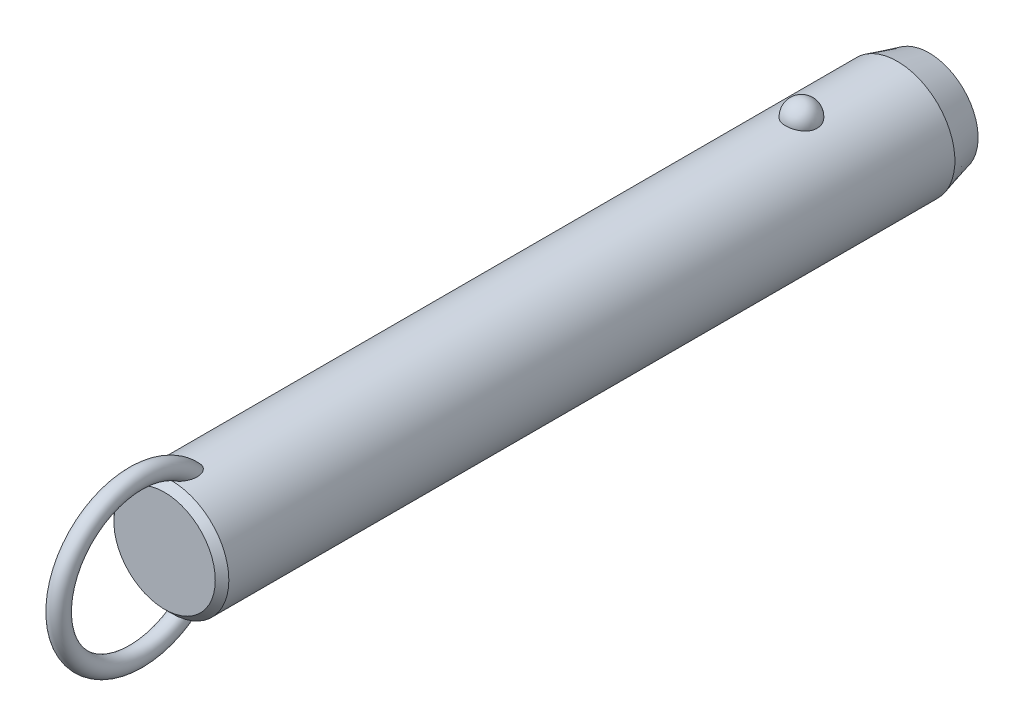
ISO-10303-21;
HEADER;
FILE_DESCRIPTION(('STEP AP214'),'2;1');
FILE_NAME('part.step','',(''),(''),'','','');
FILE_SCHEMA(('AUTOMOTIVE_DESIGN { 1 0 10303 214 1 1 1 1 }'));
ENDSEC;
DATA;
#1=APPLICATION_CONTEXT('core data for automotive mechanical design processes');
#2=APPLICATION_PROTOCOL_DEFINITION('international standard','automotive_design',2000,#1);
#3=PRODUCT_CONTEXT('',#1,'mechanical');
#4=PRODUCT('Part','Part','',(#3));
#5=PRODUCT_RELATED_PRODUCT_CATEGORY('part','',(#4));
#6=PRODUCT_DEFINITION_FORMATION('','',#4);
#7=PRODUCT_DEFINITION_CONTEXT('part definition',#1,'design');
#8=PRODUCT_DEFINITION('design','',#6,#7);
#9=PRODUCT_DEFINITION_SHAPE('','',#8);
#10=(LENGTH_UNIT() NAMED_UNIT(*) SI_UNIT(.MILLI.,.METRE.));
#11=(NAMED_UNIT(*) PLANE_ANGLE_UNIT() SI_UNIT($,.RADIAN.));
#12=(NAMED_UNIT(*) SI_UNIT($,.STERADIAN.) SOLID_ANGLE_UNIT());
#13=UNCERTAINTY_MEASURE_WITH_UNIT(LENGTH_MEASURE(1.E-05),#10,'distance_accuracy_value','');
#14=(GEOMETRIC_REPRESENTATION_CONTEXT(3) GLOBAL_UNCERTAINTY_ASSIGNED_CONTEXT((#13)) GLOBAL_UNIT_ASSIGNED_CONTEXT((#10,
#11,#12)) REPRESENTATION_CONTEXT('',''));
#15=CARTESIAN_POINT('',(0.,0.,0.));
#16=DIRECTION('',(0.,0.,1.));
#17=DIRECTION('',(1.,0.,0.));
#18=AXIS2_PLACEMENT_3D('',#15,#16,#17);
#19=CARTESIAN_POINT('',(0.,0.,124.5));
#20=DIRECTION('',(0.,0.,-1.));
#21=DIRECTION('',(-1.,0.,0.));
#22=AXIS2_PLACEMENT_3D('',#19,#20,#21);
#23=CYLINDRICAL_SURFACE('',#22,12.7);
#24=CARTESIAN_POINT('',(3.46661256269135,12.2177165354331,-3.5));
#25=CARTESIAN_POINT('',(3.4666090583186,12.2177194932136,-3.30432790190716));
#26=CARTESIAN_POINT('',(3.45063567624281,12.2222841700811,-3.10861112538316));
#27=CARTESIAN_POINT('',(3.38712451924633,12.2400345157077,-2.72271899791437));
#28=CARTESIAN_POINT('',(3.33957415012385,12.2532236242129,-2.53254588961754));
#29=CARTESIAN_POINT('',(3.2141234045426,12.286724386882,-2.16324948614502));
#30=CARTESIAN_POINT('',(3.13623639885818,12.3070329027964,-1.98412136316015));
#31=CARTESIAN_POINT('',(2.95205930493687,12.3525018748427,-1.64180592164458));
#32=CARTESIAN_POINT('',(2.84577003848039,12.3776621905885,-1.47861814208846));
#33=CARTESIAN_POINT('',(2.60688050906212,12.4301712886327,-1.17190583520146));
#34=CARTESIAN_POINT('',(2.47415697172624,12.4575299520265,-1.02847897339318));
#35=CARTESIAN_POINT('',(2.18615174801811,12.5112810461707,-0.766177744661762));
#36=CARTESIAN_POINT('',(2.03087002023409,12.5376734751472,-0.64730342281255));
#37=CARTESIAN_POINT('',(1.70237334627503,12.5864761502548,-0.437732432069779));
#38=CARTESIAN_POINT('',(1.52920948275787,12.6088972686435,-0.346958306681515));
#39=CARTESIAN_POINT('',(1.16944170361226,12.6473352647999,-0.195750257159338));
#40=CARTESIAN_POINT('',(0.982839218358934,12.663352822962,-0.135313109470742));
#41=CARTESIAN_POINT('',(0.604961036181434,12.6869706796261,-0.0473241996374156));
#42=CARTESIAN_POINT('',(0.41382314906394,12.6947125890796,-0.0192185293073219));
#43=CARTESIAN_POINT('',(0.0293827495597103,12.7014203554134,0.0051725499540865));
#44=CARTESIAN_POINT('',(-0.163919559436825,12.7003870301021,0.00146092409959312));
#45=CARTESIAN_POINT('',(-0.544374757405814,12.689735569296,-0.0373939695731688));
#46=CARTESIAN_POINT('',(-0.731575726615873,12.6802364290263,-0.0721015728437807));
#47=CARTESIAN_POINT('',(-1.09733277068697,12.6538333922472,-0.171364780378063));
#48=CARTESIAN_POINT('',(-1.27588869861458,12.6369293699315,-0.235920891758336));
#49=CARTESIAN_POINT('',(-1.6204698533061,12.5973946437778,-0.393548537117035));
#50=CARTESIAN_POINT('',(-1.78641865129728,12.5747321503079,-0.486778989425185));
#51=CARTESIAN_POINT('',(-2.10030671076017,12.5261316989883,-0.699110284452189));
#52=CARTESIAN_POINT('',(-2.24824419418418,12.5001934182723,-0.818213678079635));
#53=CARTESIAN_POINT('',(-2.52491489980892,12.4472906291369,-1.08157124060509));
#54=CARTESIAN_POINT('',(-2.65324222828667,12.4203160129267,-1.22624992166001));
#55=CARTESIAN_POINT('',(-2.88410007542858,12.3687509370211,-1.53528325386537));
#56=CARTESIAN_POINT('',(-2.98662883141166,12.3441606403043,-1.69963924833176));
#57=CARTESIAN_POINT('',(-3.16432417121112,12.2998199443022,-2.04548497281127));
#58=CARTESIAN_POINT('',(-3.23917525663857,12.2801261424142,-2.22714424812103));
#59=CARTESIAN_POINT('',(-3.35800573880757,12.248167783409,-2.6009138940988));
#60=CARTESIAN_POINT('',(-3.4019860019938,12.2359030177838,-2.79302397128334));
#61=CARTESIAN_POINT('',(-3.45784812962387,12.2202347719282,-3.18140279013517));
#62=CARTESIAN_POINT('',(-3.46986123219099,12.2167950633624,-3.37765118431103));
#63=CARTESIAN_POINT('',(-3.46186273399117,12.2190638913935,-3.76943689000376));
#64=CARTESIAN_POINT('',(-3.44185196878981,12.2247721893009,-3.96497421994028));
#65=CARTESIAN_POINT('',(-3.37048652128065,12.2446381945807,-4.34881728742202));
#66=CARTESIAN_POINT('',(-3.31928253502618,12.2587552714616,-4.53715319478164));
#67=CARTESIAN_POINT('',(-3.18693461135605,12.2938237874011,-4.90231727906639));
#68=CARTESIAN_POINT('',(-3.1057895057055,12.3147754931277,-5.07914500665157));
#69=CARTESIAN_POINT('',(-2.91506431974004,12.3613125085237,-5.41732059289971));
#70=CARTESIAN_POINT('',(-2.80533587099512,12.3869217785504,-5.57858147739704));
#71=CARTESIAN_POINT('',(-2.560414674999,12.4398525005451,-5.88013283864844));
#72=CARTESIAN_POINT('',(-2.42522099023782,12.4671740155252,-6.02042254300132));
#73=CARTESIAN_POINT('',(-2.1323357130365,12.5205965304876,-6.27662798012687));
#74=CARTESIAN_POINT('',(-1.97456596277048,12.5466928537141,-6.3924554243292));
#75=CARTESIAN_POINT('',(-1.64115839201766,12.5946384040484,-6.59583547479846));
#76=CARTESIAN_POINT('',(-1.46552179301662,12.6164879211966,-6.68339001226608));
#77=CARTESIAN_POINT('',(-1.10356050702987,12.6532533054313,-6.82682153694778));
#78=CARTESIAN_POINT('',(-0.9173913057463,12.6682500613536,-6.8830698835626));
#79=CARTESIAN_POINT('',(-0.537836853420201,12.6900288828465,-6.96386887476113));
#80=CARTESIAN_POINT('',(-0.344452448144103,12.6968119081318,-6.9884232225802));
#81=CARTESIAN_POINT('',(0.0402577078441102,12.7013667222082,-7.00496469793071));
#82=CARTESIAN_POINT('',(0.231556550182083,12.6993008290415,-6.99753844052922));
#83=CARTESIAN_POINT('',(0.610105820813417,12.6867505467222,-6.9516636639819));
#84=CARTESIAN_POINT('',(0.797356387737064,12.6762664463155,-6.913216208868));
#85=CARTESIAN_POINT('',(1.16186657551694,12.6480587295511,-6.80658431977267));
#86=CARTESIAN_POINT('',(1.33915951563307,12.6303611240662,-6.73850666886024));
#87=CARTESIAN_POINT('',(1.67968518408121,12.5896027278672,-6.5745087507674));
#88=CARTESIAN_POINT('',(1.84291705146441,12.5665416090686,-6.47858678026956));
#89=CARTESIAN_POINT('',(2.15340192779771,12.5171072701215,-6.25982455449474));
#90=CARTESIAN_POINT('',(2.30037831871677,12.4906895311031,-6.13660186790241));
#91=CARTESIAN_POINT('',(2.5717412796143,12.4376567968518,-5.86739587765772));
#92=CARTESIAN_POINT('',(2.69612388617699,12.4110417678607,-5.72140858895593));
#93=CARTESIAN_POINT('',(2.92107785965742,12.360051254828,-5.40794137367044));
#94=CARTESIAN_POINT('',(3.02121329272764,12.3357209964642,-5.24014110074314));
#95=CARTESIAN_POINT('',(3.19236291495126,12.2925446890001,-4.88969865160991));
#96=CARTESIAN_POINT('',(3.26338839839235,12.2736965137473,-4.70706226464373));
#97=CARTESIAN_POINT('',(3.36788038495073,12.245404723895,-4.35469510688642));
#98=CARTESIAN_POINT('',(3.40484026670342,12.2351018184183,-4.18605935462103));
#99=CARTESIAN_POINT('',(3.45420764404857,12.2212564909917,-3.84496058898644));
#100=CARTESIAN_POINT('',(3.46661565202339,12.2177139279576,-3.67249765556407));
#101=CARTESIAN_POINT('',(3.46661256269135,12.2177165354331,-3.5));
#102=B_SPLINE_CURVE_WITH_KNOTS('',3,(#24,#25,#26,#27,#28,#29,#30,#31,#32,#33,#34,#35,#36,#37,
#38,#39,#40,#41,#42,#43,#44,#45,#46,#47,#48,#49,#50,#51,#52,#53,#54,#55,#56,#57,#58,#59,#60,#61,
#62,#63,#64,#65,#66,#67,#68,#69,#70,#71,#72,#73,#74,#75,#76,#77,#78,#79,#80,#81,#82,#83,#84,#85,
#86,#87,#88,#89,#90,#91,#92,#93,#94,#95,#96,#97,#98,#99,#100,#101),.UNSPECIFIED.,.T.,.F.,(4,2,2,
2,2,2,2,2,2,2,2,2,2,2,2,2,2,2,2,2,2,2,2,2,2,2,2,2,2,2,2,2,2,2,2,2,2,2,4),(0.,0.586396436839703,
1.17302689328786,1.7593990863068,2.34575431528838,2.93491084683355,3.52406845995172,
4.11158733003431,4.69904375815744,5.2762784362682,5.85345931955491,6.42265312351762,
6.99185659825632,7.56427334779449,8.136746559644,8.71981013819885,9.3029135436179,
9.89247258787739,10.4820150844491,11.0691335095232,11.6562366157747,12.2405256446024,
12.8248374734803,13.412244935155,13.9996740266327,14.5891883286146,15.1786623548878,
15.7609861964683,16.3432419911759,16.9148635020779,17.4864654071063,18.0560241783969,
18.6256177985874,19.2037609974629,19.7820055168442,20.3699810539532,20.957728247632,
21.4746855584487,21.9916320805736),.UNSPECIFIED.);
#103=CARTESIAN_POINT('',(3.46661256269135,12.2177165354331,-3.5));
#104=VERTEX_POINT('',#103);
#105=EDGE_CURVE('E41',#104,#104,#102,.T.);
#106=ORIENTED_EDGE('',*,*,#105,.T.);
#107=EDGE_LOOP('',(#106));
#108=FACE_BOUND('',#107,.T.);
#109=CARTESIAN_POINT('',(0.,0.,135.7));
#110=DIRECTION('',(0.,0.,1.));
#111=DIRECTION('',(1.,0.,0.));
#112=AXIS2_PLACEMENT_3D('',#109,#110,#111);
#113=CIRCLE('',#112,12.7);
#114=CARTESIAN_POINT('',(12.7,0.,135.7));
#115=VERTEX_POINT('',#114);
#116=EDGE_CURVE('E10',#115,#115,#113,.F.);
#117=ORIENTED_EDGE('',*,*,#116,.T.);
#118=EDGE_LOOP('',(#117));
#119=FACE_BOUND('',#118,.T.);
#120=CARTESIAN_POINT('',(-0.548122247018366,-12.6881662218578,129.443218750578));
#121=CARTESIAN_POINT('',(-0.648865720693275,-12.6838128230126,129.477926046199));
#122=CARTESIAN_POINT('',(-0.746398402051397,-12.6783867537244,129.522042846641));
#123=CARTESIAN_POINT('',(-0.932125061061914,-12.666091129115,129.626764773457));
#124=CARTESIAN_POINT('',(-1.02030388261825,-12.6592192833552,129.687396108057));
#125=CARTESIAN_POINT('',(-1.18487740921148,-12.6448747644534,129.821847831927));
#126=CARTESIAN_POINT('',(-1.26134296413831,-12.637406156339,129.895582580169));
#127=CARTESIAN_POINT('',(-1.4023120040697,-12.6225412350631,130.053604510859));
#128=CARTESIAN_POINT('',(-1.466814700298,-12.6151449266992,130.13789238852));
#129=CARTESIAN_POINT('',(-1.60714786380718,-12.5981718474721,130.349657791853));
#130=CARTESIAN_POINT('',(-1.67725126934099,-12.588900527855,130.480962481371));
#131=CARTESIAN_POINT('',(-1.79536591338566,-12.5725964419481,130.753247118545));
#132=CARTESIAN_POINT('',(-1.84333535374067,-12.5655679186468,130.894244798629));
#133=CARTESIAN_POINT('',(-1.93422576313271,-12.5519624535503,131.237645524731));
#134=CARTESIAN_POINT('',(-1.96788773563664,-12.5466298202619,131.442557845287));
#135=CARTESIAN_POINT('',(-1.9941399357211,-12.542463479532,131.751760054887));
#136=CARTESIAN_POINT('',(-1.99883864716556,-12.5417153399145,131.855298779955));
#137=CARTESIAN_POINT('',(-2.00078003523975,-12.5414074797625,132.06245124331));
#138=CARTESIAN_POINT('',(-1.99802449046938,-12.5418474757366,132.166064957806));
#139=CARTESIAN_POINT('',(-1.98336733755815,-12.5441750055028,132.41032076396));
#140=CARTESIAN_POINT('',(-1.96851430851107,-12.5465291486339,132.550780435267));
#141=CARTESIAN_POINT('',(-1.92707089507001,-12.5529612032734,132.829960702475));
#142=CARTESIAN_POINT('',(-1.90047458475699,-12.5570399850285,132.968680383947));
#143=CARTESIAN_POINT('',(-1.8361912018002,-12.5666008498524,133.24341135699));
#144=CARTESIAN_POINT('',(-1.79850828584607,-12.57208240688,133.379423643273));
#145=CARTESIAN_POINT('',(-1.71223796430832,-12.5841228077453,133.647842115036));
#146=CARTESIAN_POINT('',(-1.66365679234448,-12.5906810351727,133.780250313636));
#147=CARTESIAN_POINT('',(-1.5780450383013,-12.6016176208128,133.98548877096));
#148=CARTESIAN_POINT('',(-1.54477252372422,-12.6057501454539,134.059914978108));
#149=CARTESIAN_POINT('',(-1.47424480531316,-12.6141930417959,134.206839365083));
#150=CARTESIAN_POINT('',(-1.436990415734,-12.6185033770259,134.279337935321));
#151=CARTESIAN_POINT('',(-1.35825795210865,-12.6272207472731,134.421892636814));
#152=CARTESIAN_POINT('',(-1.31678520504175,-12.6316276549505,134.491951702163));
#153=CARTESIAN_POINT('',(-1.22917793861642,-12.6404532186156,134.629070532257));
#154=CARTESIAN_POINT('',(-1.18304514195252,-12.6448718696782,134.696131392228));
#155=CARTESIAN_POINT('',(-1.0724641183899,-12.6547893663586,134.843874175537));
#156=CARTESIAN_POINT('',(-1.00642239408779,-12.6602600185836,134.923384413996));
#157=CARTESIAN_POINT('',(-0.864441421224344,-12.6707460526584,135.073169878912));
#158=CARTESIAN_POINT('',(-0.78851691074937,-12.6757620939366,135.143458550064));
#159=CARTESIAN_POINT('',(-0.65221547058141,-12.6833591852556,135.248680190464));
#160=CARTESIAN_POINT('',(-0.59498203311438,-12.6861973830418,135.287624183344));
#161=CARTESIAN_POINT('',(-0.475269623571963,-12.6912445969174,135.356489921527));
#162=CARTESIAN_POINT('',(-0.412800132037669,-12.6934547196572,135.386427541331));
#163=CARTESIAN_POINT('',(-0.295749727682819,-12.6966636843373,135.42975652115));
#164=CARTESIAN_POINT('',(-0.241949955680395,-12.6978134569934,135.445218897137));
#165=CARTESIAN_POINT('',(-0.132508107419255,-12.6994261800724,135.466884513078));
#166=CARTESIAN_POINT('',(-0.0768679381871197,-12.6998898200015,135.473097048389));
#167=CARTESIAN_POINT('',(0.03476966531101,-12.7000752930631,135.475583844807));
#168=CARTESIAN_POINT('',(0.0907676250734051,-12.6997954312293,135.471835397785));
#169=CARTESIAN_POINT('',(0.201283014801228,-12.6985255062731,135.454788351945));
#170=CARTESIAN_POINT('',(0.255799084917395,-12.6975348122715,135.441481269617));
#171=CARTESIAN_POINT('',(0.376042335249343,-12.6946091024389,135.40203792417));
#172=CARTESIAN_POINT('',(0.440950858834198,-12.6924943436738,135.373449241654));
#173=CARTESIAN_POINT('',(0.565350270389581,-12.6875639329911,135.306323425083));
#174=CARTESIAN_POINT('',(0.624828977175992,-12.6847467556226,135.267764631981));
#175=CARTESIAN_POINT('',(0.774116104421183,-12.6767252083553,135.156949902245));
#176=CARTESIAN_POINT('',(0.859449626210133,-12.6711344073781,135.078760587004));
#177=CARTESIAN_POINT('',(1.01789440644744,-12.6593922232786,134.910943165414));
#178=CARTESIAN_POINT('',(1.09096902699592,-12.653239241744,134.821282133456));
#179=CARTESIAN_POINT('',(1.22268793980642,-12.6411674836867,134.640265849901));
#180=CARTESIAN_POINT('',(1.28193986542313,-12.6352572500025,134.549345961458));
#181=CARTESIAN_POINT('',(1.39259777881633,-12.6235401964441,134.362792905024));
#182=CARTESIAN_POINT('',(1.44399707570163,-12.6177334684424,134.267155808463));
#183=CARTESIAN_POINT('',(1.53972870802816,-12.6064093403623,134.072273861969));
#184=CARTESIAN_POINT('',(1.58405262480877,-12.6008922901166,133.973024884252));
#185=CARTESIAN_POINT('',(1.66600705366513,-12.5903187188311,133.771772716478));
#186=CARTESIAN_POINT('',(1.70363651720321,-12.5852622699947,133.669769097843));
#187=CARTESIAN_POINT('',(1.77545379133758,-12.5753406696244,133.454358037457));
#188=CARTESIAN_POINT('',(1.80903453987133,-12.5705328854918,133.340745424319));
#189=CARTESIAN_POINT('',(1.86844163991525,-12.5618400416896,133.111457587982));
#190=CARTESIAN_POINT('',(1.89426665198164,-12.5579551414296,132.995782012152));
#191=CARTESIAN_POINT('',(1.9378546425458,-12.5513030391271,132.763007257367));
#192=CARTESIAN_POINT('',(1.9556264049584,-12.5485346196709,132.645909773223));
#193=CARTESIAN_POINT('',(1.98264463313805,-12.5442934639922,132.410747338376));
#194=CARTESIAN_POINT('',(1.99189298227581,-12.5428204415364,132.29268260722));
#195=CARTESIAN_POINT('',(2.00416068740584,-12.540871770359,131.980622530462));
#196=CARTESIAN_POINT('',(1.99944433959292,-12.541631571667,131.786229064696));
#197=CARTESIAN_POINT('',(1.96113755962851,-12.5476846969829,131.400309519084));
#198=CARTESIAN_POINT('',(1.92758341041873,-12.5529723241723,131.208780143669));
#199=CARTESIAN_POINT('',(1.83934342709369,-12.5661532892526,130.882272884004));
#200=CARTESIAN_POINT('',(1.79215440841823,-12.5730485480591,130.74524997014));
#201=CARTESIAN_POINT('',(1.67676242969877,-12.588958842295,130.480445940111));
#202=CARTESIAN_POINT('',(1.60859050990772,-12.597970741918,130.352651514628));
#203=CARTESIAN_POINT('',(1.46583832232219,-12.6152829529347,130.135800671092));
#204=CARTESIAN_POINT('',(1.39525727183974,-12.6233659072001,130.04410500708));
#205=CARTESIAN_POINT('',(1.23992594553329,-12.6395676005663,129.873485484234));
#206=CARTESIAN_POINT('',(1.15517932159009,-12.6476863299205,129.794558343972));
#207=CARTESIAN_POINT('',(0.971995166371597,-12.6630846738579,129.652643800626));
#208=CARTESIAN_POINT('',(0.873456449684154,-12.6703572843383,129.589784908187));
#209=CARTESIAN_POINT('',(0.665847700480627,-12.6829569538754,129.484487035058));
#210=CARTESIAN_POINT('',(0.556784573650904,-12.688285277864,129.442034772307));
#211=CARTESIAN_POINT('',(0.347338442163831,-12.6956226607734,129.384443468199));
#212=CARTESIAN_POINT('',(0.247759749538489,-12.6979816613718,129.366399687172));
#213=CARTESIAN_POINT('',(0.0470218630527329,-12.7003077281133,129.348600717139));
#214=CARTESIAN_POINT('',(-0.0541350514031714,-12.7002779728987,129.348821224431));
#215=CARTESIAN_POINT('',(-0.221414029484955,-12.6982482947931,129.364363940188));
#216=CARTESIAN_POINT('',(-0.288055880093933,-12.6969033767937,129.374666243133));
#217=CARTESIAN_POINT('',(-0.419599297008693,-12.6932369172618,129.40313489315));
#218=CARTESIAN_POINT('',(-0.484501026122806,-12.6909154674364,129.421300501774));
#219=CARTESIAN_POINT('',(-0.548122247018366,-12.6881662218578,129.443218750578));
#220=B_SPLINE_CURVE_WITH_KNOTS('',3,(#120,#121,#122,#123,#124,#125,#126,#127,#128,#129,#130,
#131,#132,#133,#134,#135,#136,#137,#138,#139,#140,#141,#142,#143,#144,#145,#146,#147,#148,#149,
#150,#151,#152,#153,#154,#155,#156,#157,#158,#159,#160,#161,#162,#163,#164,#165,#166,#167,#168,
#169,#170,#171,#172,#173,#174,#175,#176,#177,#178,#179,#180,#181,#182,#183,#184,#185,#186,#187,
#188,#189,#190,#191,#192,#193,#194,#195,#196,#197,#198,#199,#200,#201,#202,#203,#204,#205,#206,
#207,#208,#209,#210,#211,#212,#213,#214,#215,#216,#217,#218,#219),.UNSPECIFIED.,.T.,.F.,(4,2,2,
2,2,2,2,2,2,2,2,2,2,2,2,2,2,2,2,2,2,2,2,2,2,2,2,2,2,2,2,2,2,2,2,2,2,2,2,2,2,2,2,2,2,2,2,2,2,4),
(0.,0.31964225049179,0.639794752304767,0.957927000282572,1.27608021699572,1.72100165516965,
2.16675988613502,2.78630021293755,3.09705782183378,3.40774128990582,3.83096358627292,
4.25439969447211,4.67767724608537,5.10071330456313,5.34550297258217,5.59024267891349,
5.83467707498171,6.07902143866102,6.38891080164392,6.69834321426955,6.9056091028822,
7.11250749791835,7.27977315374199,7.44687060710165,7.61434932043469,7.78197685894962,
7.99365544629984,8.20579780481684,8.55147335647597,8.89816429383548,9.22375138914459,
9.54961437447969,9.8758622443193,10.202161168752,10.557587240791,10.9130746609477,
11.2681734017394,11.6231936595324,12.2046601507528,12.7853961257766,13.219164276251,
13.6522938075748,13.9989174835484,14.3454519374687,14.6946768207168,15.0436740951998,
15.3457513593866,15.6474266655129,15.8493051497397,16.0511646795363),.UNSPECIFIED.);
#221=CARTESIAN_POINT('',(-0.548122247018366,-12.6881662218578,129.443218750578));
#222=VERTEX_POINT('',#221);
#223=EDGE_CURVE('E59',#222,#222,#220,.T.);
#224=ORIENTED_EDGE('',*,*,#223,.T.);
#225=EDGE_LOOP('',(#224));
#226=FACE_BOUND('',#225,.T.);
#227=CARTESIAN_POINT('',(-0.548122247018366,12.6881662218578,129.443218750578));
#228=CARTESIAN_POINT('',(-0.459436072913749,12.6919968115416,129.412673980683));
#229=CARTESIAN_POINT('',(-0.368189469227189,12.6949996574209,129.389391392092));
#230=CARTESIAN_POINT('',(-0.18302400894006,12.6990186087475,129.358406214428));
#231=CARTESIAN_POINT('',(-0.0891049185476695,12.7000345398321,129.350704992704));
#232=CARTESIAN_POINT('',(0.0987147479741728,12.6999636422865,129.351245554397));
#233=CARTESIAN_POINT('',(0.192615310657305,12.6988761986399,129.359492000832));
#234=CARTESIAN_POINT('',(0.377658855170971,12.6947211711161,129.391551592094));
#235=CARTESIAN_POINT('',(0.468801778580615,12.6916535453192,129.415365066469));
#236=CARTESIAN_POINT('',(0.645809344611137,12.6838788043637,129.47745651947));
#237=CARTESIAN_POINT('',(0.731679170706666,12.6791733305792,129.515720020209));
#238=CARTESIAN_POINT('',(0.896315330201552,12.6686004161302,129.605120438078));
#239=CARTESIAN_POINT('',(0.975080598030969,12.6627328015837,129.656259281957));
#240=CARTESIAN_POINT('',(1.12963655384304,12.6499161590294,129.77367820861));
#241=CARTESIAN_POINT('',(1.20478673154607,12.6429194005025,129.840792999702));
#242=CARTESIAN_POINT('',(1.34448241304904,12.6288282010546,129.98522507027));
#243=CARTESIAN_POINT('',(1.40902173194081,12.621733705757,130.062548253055));
#244=CARTESIAN_POINT('',(1.55208211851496,12.6050877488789,130.259247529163));
#245=CARTESIAN_POINT('',(1.62510490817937,12.5957546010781,130.382654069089));
#246=CARTESIAN_POINT('',(1.7501904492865,12.5789823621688,130.639769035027));
#247=CARTESIAN_POINT('',(1.80221377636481,12.5715468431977,130.773496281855));
#248=CARTESIAN_POINT('',(1.90309965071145,12.5567434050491,131.098351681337));
#249=CARTESIAN_POINT('',(1.94342317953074,12.5504515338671,131.292161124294));
#250=CARTESIAN_POINT('',(1.99332997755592,12.5426147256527,131.68378810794));
#251=CARTESIAN_POINT('',(2.00285305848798,12.5410790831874,131.881612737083));
#252=CARTESIAN_POINT('',(1.99678999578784,12.5420407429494,132.216642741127));
#253=CARTESIAN_POINT('',(1.98794117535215,12.5434564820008,132.354042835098));
#254=CARTESIAN_POINT('',(1.95865119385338,12.5480641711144,132.627639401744));
#255=CARTESIAN_POINT('',(1.93820436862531,12.5512569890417,132.763835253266));
#256=CARTESIAN_POINT('',(1.88647896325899,12.5591352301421,133.034249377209));
#257=CARTESIAN_POINT('',(1.85518800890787,12.5638223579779,133.168465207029));
#258=CARTESIAN_POINT('',(1.78217886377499,12.5743868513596,133.433936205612));
#259=CARTESIAN_POINT('',(1.74046509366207,12.5802637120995,133.565192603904));
#260=CARTESIAN_POINT('',(1.66024095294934,12.5910571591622,133.786085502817));
#261=CARTESIAN_POINT('',(1.62434772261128,12.5957535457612,133.876690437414));
#262=CARTESIAN_POINT('',(1.54709009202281,12.6054762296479,134.055512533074));
#263=CARTESIAN_POINT('',(1.50572681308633,12.6105024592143,134.143730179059));
#264=CARTESIAN_POINT('',(1.41728020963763,12.620748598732,134.316932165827));
#265=CARTESIAN_POINT('',(1.37021377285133,12.625967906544,134.401925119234));
#266=CARTESIAN_POINT('',(1.26969620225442,12.6364721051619,134.568007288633));
#267=CARTESIAN_POINT('',(1.21624929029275,12.6417569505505,134.649099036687));
#268=CARTESIAN_POINT('',(1.10304413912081,12.6521331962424,134.804702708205));
#269=CARTESIAN_POINT('',(1.04340936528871,12.657226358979,134.879303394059));
#270=CARTESIAN_POINT('',(0.915919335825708,12.667090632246,135.021324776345));
#271=CARTESIAN_POINT('',(0.84806456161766,12.6718617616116,135.08874589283));
#272=CARTESIAN_POINT('',(0.717035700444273,12.67987711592,135.200624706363));
#273=CARTESIAN_POINT('',(0.655526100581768,12.6832377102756,135.246997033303));
#274=CARTESIAN_POINT('',(0.525985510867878,12.6892676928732,135.329619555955));
#275=CARTESIAN_POINT('',(0.457969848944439,12.6919386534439,135.365892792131));
#276=CARTESIAN_POINT('',(0.334859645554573,12.695691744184,135.416657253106));
#277=CARTESIAN_POINT('',(0.281116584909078,12.6970073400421,135.434373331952));
#278=CARTESIAN_POINT('',(0.171425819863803,12.6989609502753,135.460642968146));
#279=CARTESIAN_POINT('',(0.115480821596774,12.699599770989,135.469207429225));
#280=CARTESIAN_POINT('',(0.00272618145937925,12.7001251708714,135.476253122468));
#281=CARTESIAN_POINT('',(-0.0540859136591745,12.7000089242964,135.474696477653));
#282=CARTESIAN_POINT('',(-0.166544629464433,12.6990328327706,135.461600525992));
#283=CARTESIAN_POINT('',(-0.222190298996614,12.6981724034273,135.450053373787));
#284=CARTESIAN_POINT('',(-0.342018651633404,12.695562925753,135.414912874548));
#285=CARTESIAN_POINT('',(-0.405606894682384,12.6936676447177,135.38933225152));
#286=CARTESIAN_POINT('',(-0.527815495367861,12.6891754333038,135.328311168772));
#287=CARTESIAN_POINT('',(-0.586425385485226,12.6865770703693,135.292850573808));
#288=CARTESIAN_POINT('',(-0.731842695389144,12.6792129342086,135.191496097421));
#289=CARTESIAN_POINT('',(-0.81470941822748,12.6740767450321,135.1200395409));
#290=CARTESIAN_POINT('',(-0.969101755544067,12.6632083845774,134.96589007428));
#291=CARTESIAN_POINT('',(-1.04059564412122,12.6574746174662,134.883166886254));
#292=CARTESIAN_POINT('',(-1.16981116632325,12.6461638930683,134.715809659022));
#293=CARTESIAN_POINT('',(-1.22811369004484,12.6405994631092,134.631616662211));
#294=CARTESIAN_POINT('',(-1.33743405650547,12.6295007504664,134.458579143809));
#295=CARTESIAN_POINT('',(-1.38844577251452,12.6239664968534,134.369730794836));
#296=CARTESIAN_POINT('',(-1.48400702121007,12.6130898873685,134.188389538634));
#297=CARTESIAN_POINT('',(-1.52854232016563,12.6077479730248,134.095889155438));
#298=CARTESIAN_POINT('',(-1.61150113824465,12.5974127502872,133.908160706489));
#299=CARTESIAN_POINT('',(-1.64992317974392,12.5924195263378,133.812931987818));
#300=CARTESIAN_POINT('',(-1.73468589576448,12.581070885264,133.58289362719));
#301=CARTESIAN_POINT('',(-1.77831261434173,12.5749388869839,133.447066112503));
#302=CARTESIAN_POINT('',(-1.85439734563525,12.5639437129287,133.172212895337));
#303=CARTESIAN_POINT('',(-1.88684994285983,12.5590811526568,133.033185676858));
#304=CARTESIAN_POINT('',(-1.94008483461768,12.550968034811,132.75309235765));
#305=CARTESIAN_POINT('',(-1.96088706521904,12.5477147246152,132.612030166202));
#306=CARTESIAN_POINT('',(-1.99000539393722,12.5431291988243,132.328668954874));
#307=CARTESIAN_POINT('',(-1.99832911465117,12.5417958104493,132.186370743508));
#308=CARTESIAN_POINT('',(-2.00166624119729,12.5412674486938,131.857627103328));
#309=CARTESIAN_POINT('',(-1.99178843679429,12.5428579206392,131.671088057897));
#310=CARTESIAN_POINT('',(-1.94455183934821,12.5502731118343,131.30162404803));
#311=CARTESIAN_POINT('',(-1.90724032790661,12.5560905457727,131.118693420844));
#312=CARTESIAN_POINT('',(-1.81330718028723,12.5699462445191,130.804848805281));
#313=CARTESIAN_POINT('',(-1.76338820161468,12.5771273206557,130.671910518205));
#314=CARTESIAN_POINT('',(-1.64305018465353,12.593414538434,130.415681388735));
#315=CARTESIAN_POINT('',(-1.57265346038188,12.6025185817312,130.292380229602));
#316=CARTESIAN_POINT('',(-1.42634956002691,12.6198178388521,130.083564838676));
#317=CARTESIAN_POINT('',(-1.35423772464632,12.6278405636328,129.995384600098));
#318=CARTESIAN_POINT('',(-1.19645664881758,12.6437632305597,129.832107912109));
#319=CARTESIAN_POINT('',(-1.1108053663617,12.6516633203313,129.756994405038));
#320=CARTESIAN_POINT('',(-0.947219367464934,12.6648319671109,129.637811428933));
#321=CARTESIAN_POINT('',(-0.871624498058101,12.670300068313,129.590541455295));
#322=CARTESIAN_POINT('',(-0.714161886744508,12.6801492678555,129.5077413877));
#323=CARTESIAN_POINT('',(-0.632295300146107,12.684530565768,129.47220913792));
#324=CARTESIAN_POINT('',(-0.548122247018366,12.6881662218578,129.443218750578));
#325=B_SPLINE_CURVE_WITH_KNOTS('',3,(#227,#228,#229,#230,#231,#232,#233,#234,#235,#236,#237,
#238,#239,#240,#241,#242,#243,#244,#245,#246,#247,#248,#249,#250,#251,#252,#253,#254,#255,#256,
#257,#258,#259,#260,#261,#262,#263,#264,#265,#266,#267,#268,#269,#270,#271,#272,#273,#274,#275,
#276,#277,#278,#279,#280,#281,#282,#283,#284,#285,#286,#287,#288,#289,#290,#291,#292,#293,#294,
#295,#296,#297,#298,#299,#300,#301,#302,#303,#304,#305,#306,#307,#308,#309,#310,#311,#312,#313,
#314,#315,#316,#317,#318,#319,#320,#321,#322,#323,#324),.UNSPECIFIED.,.T.,.F.,(4,2,2,2,2,2,2,2,
2,2,2,2,2,2,2,2,2,2,2,2,2,2,2,2,2,2,2,2,2,2,2,2,2,2,2,2,2,2,2,2,2,2,2,2,2,2,2,2,4),(0.,
0.281328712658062,0.562682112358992,0.844117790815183,1.12555942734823,1.40671982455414,
1.68792232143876,1.98972294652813,2.29169886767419,2.72039860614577,3.14989948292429,
3.74084916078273,4.33295293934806,4.74554109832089,5.15833092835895,5.57159335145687,
5.98468079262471,6.27722775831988,6.56971484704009,6.86135609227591,7.15280542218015,
7.43927407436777,7.72572595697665,7.95635862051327,8.18646071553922,8.35559393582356,
8.52452541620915,8.6940894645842,8.86378678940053,9.06834348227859,9.27332014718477,
9.60010414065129,9.92778432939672,10.2350252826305,10.5425229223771,10.8506864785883,
11.15892440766,11.5867893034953,12.0148612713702,12.4421984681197,12.8692745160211,
13.4279365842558,13.9856380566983,14.4107062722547,14.835313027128,15.1765567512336,
15.517351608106,15.7844129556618,16.051425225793),.UNSPECIFIED.);
#326=CARTESIAN_POINT('',(-0.548122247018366,12.6881662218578,129.443218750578));
#327=VERTEX_POINT('',#326);
#328=EDGE_CURVE('E67',#327,#327,#325,.T.);
#329=ORIENTED_EDGE('',*,*,#328,.T.);
#330=EDGE_LOOP('',(#329));
#331=FACE_BOUND('',#330,.T.);
#332=CARTESIAN_POINT('',(0.,0.,-24.6999999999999));
#333=DIRECTION('',(0.,0.,-1.));
#334=DIRECTION('',(-1.,0.,0.));
#335=AXIS2_PLACEMENT_3D('',#332,#333,#334);
#336=CIRCLE('',#335,12.7);
#337=CARTESIAN_POINT('',(-12.7,0.,-24.6999999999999));
#338=VERTEX_POINT('',#337);
#339=EDGE_CURVE('E56',#338,#338,#336,.F.);
#340=ORIENTED_EDGE('',*,*,#339,.T.);
#341=EDGE_LOOP('',(#340));
#342=FACE_BOUND('',#341,.T.);
#343=ADVANCED_FACE('F37',(#108,#119,#226,#331,#342),#23,.T.);
#344=CARTESIAN_POINT('',(0.,0.,-31.7));
#345=DIRECTION('',(0.,0.,-1.));
#346=DIRECTION('',(-1.,0.,0.));
#347=AXIS2_PLACEMENT_3D('',#344,#345,#346);
#348=PLANE('',#347);
#349=CARTESIAN_POINT('',(0.,0.,-31.7));
#350=DIRECTION('',(0.,0.,-1.));
#351=DIRECTION('',(-1.,0.,0.));
#352=AXIS2_PLACEMENT_3D('',#349,#350,#351);
#353=CIRCLE('',#352,10.8243556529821);
#354=CARTESIAN_POINT('',(-10.8243556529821,0.,-31.7));
#355=VERTEX_POINT('',#354);
#356=EDGE_CURVE('E66',#355,#355,#353,.T.);
#357=ORIENTED_EDGE('',*,*,#356,.T.);
#358=EDGE_LOOP('',(#357));
#359=FACE_BOUND('',#358,.T.);
#360=ADVANCED_FACE('F85',(#359),#348,.T.);
#361=CARTESIAN_POINT('',(0.,0.,-31.7));
#362=DIRECTION('',(0.,0.,1.));
#363=DIRECTION('',(1.,0.,0.));
#364=AXIS2_PLACEMENT_3D('',#361,#362,#363);
#365=CONICAL_SURFACE('',#364,10.8243556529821,0.261799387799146);
#366=ORIENTED_EDGE('',*,*,#339,.F.);
#367=EDGE_LOOP('',(#366));
#368=FACE_BOUND('',#367,.T.);
#369=ORIENTED_EDGE('',*,*,#356,.F.);
#370=EDGE_LOOP('',(#369));
#371=FACE_BOUND('',#370,.T.);
#372=ADVANCED_FACE('F83',(#368,#371),#365,.T.);
#373=CARTESIAN_POINT('',(0.,0.,137.2));
#374=DIRECTION('',(0.,0.,1.));
#375=DIRECTION('',(1.,0.,0.));
#376=AXIS2_PLACEMENT_3D('',#373,#374,#375);
#377=PLANE('',#376);
#378=CARTESIAN_POINT('',(0.,0.,137.2));
#379=DIRECTION('',(0.,0.,1.));
#380=DIRECTION('',(1.,0.,0.));
#381=AXIS2_PLACEMENT_3D('',#378,#379,#380);
#382=CIRCLE('',#381,11.2);
#383=CARTESIAN_POINT('',(11.2,0.,137.2));
#384=VERTEX_POINT('',#383);
#385=EDGE_CURVE('E50',#384,#384,#382,.T.);
#386=ORIENTED_EDGE('',*,*,#385,.T.);
#387=EDGE_LOOP('',(#386));
#388=FACE_BOUND('',#387,.T.);
#389=ADVANCED_FACE('F77',(#388),#377,.T.);
#390=CARTESIAN_POINT('',(0.,0.,143.55));
#391=DIRECTION('',(1.,0.,0.));
#392=DIRECTION('',(0.,0.,-1.));
#393=AXIS2_PLACEMENT_3D('',#390,#391,#392);
#394=TOROIDAL_SURFACE('',#393,17.05,2.);
#395=ORIENTED_EDGE('',*,*,#328,.F.);
#396=EDGE_LOOP('',(#395));
#397=FACE_BOUND('',#396,.T.);
#398=ORIENTED_EDGE('',*,*,#223,.F.);
#399=EDGE_LOOP('',(#398));
#400=FACE_BOUND('',#399,.T.);
#401=ADVANCED_FACE('F73',(#397,#400),#394,.T.);
#402=CARTESIAN_POINT('',(0.,0.,137.2));
#403=DIRECTION('',(0.,0.,-1.));
#404=DIRECTION('',(-1.,0.,0.));
#405=AXIS2_PLACEMENT_3D('',#402,#403,#404);
#406=CONICAL_SURFACE('',#405,11.2,0.785398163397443);
#407=ORIENTED_EDGE('',*,*,#116,.F.);
#408=EDGE_LOOP('',(#407));
#409=FACE_BOUND('',#408,.T.);
#410=ORIENTED_EDGE('',*,*,#385,.F.);
#411=EDGE_LOOP('',(#410));
#412=FACE_BOUND('',#411,.T.);
#413=ADVANCED_FACE('F39',(#409,#412),#406,.T.);
#414=CARTESIAN_POINT('',(0.,12.7,-3.5));
#415=DIRECTION('',(0.,1.,0.));
#416=DIRECTION('',(0.,0.,-1.));
#417=AXIS2_PLACEMENT_3D('',#414,#415,#416);
#418=SPHERICAL_SURFACE('',#417,3.5);
#419=ORIENTED_EDGE('',*,*,#105,.F.);
#420=EDGE_LOOP('',(#419));
#421=FACE_BOUND('',#420,.T.);
#422=ADVANCED_FACE('F79',(#421),#418,.T.);
#423=CLOSED_SHELL('',(#343,#360,#372,#389,#401,#413,#422));
#424=MANIFOLD_SOLID_BREP('B2',#423);
#425=ADVANCED_BREP_SHAPE_REPRESENTATION('',(#18,#424),#14);
#426=SHAPE_DEFINITION_REPRESENTATION(#9,#425);
ENDSEC;
END-ISO-10303-21;
